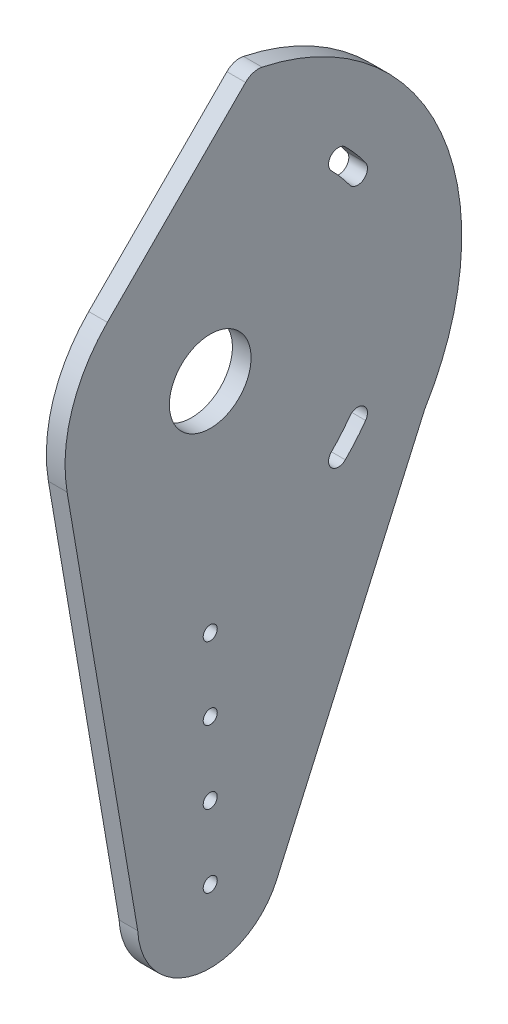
from build123d import *

# Parameters (mm, degrees)
SKETCH1_R                    = 14.2875
BOSS_EXTRUDE1_DEPTH          = 6.5278
F_10_0_1935_DIAMETER_HOLE1_D = 4.9149
FILLET1_R                    = 6.35


with BuildPart() as part:
    # Sketch1 → Boss-Extrude1 (new body)
    with BuildSketch(Plane(origin=(0, 0, 0), x_dir=(0, 0, -1), z_dir=(1, 0, 0))):
        with BuildLine():
            Line((-35.983333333, 35.858607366), (14.728395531, 86.746725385))
            ThreePointArc((14.728395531, 86.746725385), (80.099939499, 36.413180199), (75.045459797, -45.935813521))
            Line((75.045459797, -45.935813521), (23.215800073, -162.704689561))
            ThreePointArc((23.215800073, -162.704689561), (-4.589455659, -177.381931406), (-25.362466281, -153.780327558))
            Line((-25.362466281, -153.780327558), (-38.171300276, -78.506516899))
            Line((-38.171300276, -78.506516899), (-50.08012582, -8.521795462))
            ThreePointArc((-50.08012582, -8.521795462), (-48.41626575, 15.378725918), (-35.983333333, 35.858607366))
        make_face()
        with Locations(Location((0, 0, 0), (0, 0, 180))):
            Circle(SKETCH1_R, mode=Mode.SUBTRACT)
        with BuildLine():
            ThreePointArc((54.361933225, 39.041916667), (50.974748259, 43.371258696), (47.243715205, 47.408041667))
            ThreePointArc((47.243715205, 47.408041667), (42.394384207, 47.399622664), (42.40280321, 42.550291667))
            ThreePointArc((42.40280321, 42.550291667), (45.751529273, 38.927144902), (48.791640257, 35.041416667))
            ThreePointArc((48.791640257, 35.041416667), (53.577036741, 34.256520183), (54.361933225, 39.041916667))
        make_face(mode=Mode.SUBTRACT)
        with BuildLine():
            ThreePointArc((54.361933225, -39.041916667), (50.974748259, -43.371258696), (47.243715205, -47.408041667))
            ThreePointArc((47.243715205, -47.408041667), (42.394384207, -47.399622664), (42.40280321, -42.550291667))
            ThreePointArc((42.40280321, -42.550291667), (45.751529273, -38.927144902), (48.791640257, -35.041416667))
            ThreePointArc((48.791640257, -35.041416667), (53.577036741, -34.256520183), (54.361933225, -39.041916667))
        make_face(mode=Mode.SUBTRACT)
    extrude(amount=BOSS_EXTRUDE1_DEPTH)

    # 10 _0.1935_ Diameter Hole1 (through all)
    with Locations(Plane(origin=(6.5278, 0, 0), x_dir=(0, 0, -1), z_dir=(1, 0, 0))):
        with Locations((0, -152.4), (0, -127), (0, -101.6), (0, -76.2)):
            Hole(F_10_0_1935_DIAMETER_HOLE1_D / 2)

    # Fillet1
    fillet1_edges = [part.edges().sort_by_distance(p)[0] for p in [
        (3.2639, 86.746725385, -14.728395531),
    ]]
    fillet(fillet1_edges, radius=FILLET1_R)


solid = part.part
